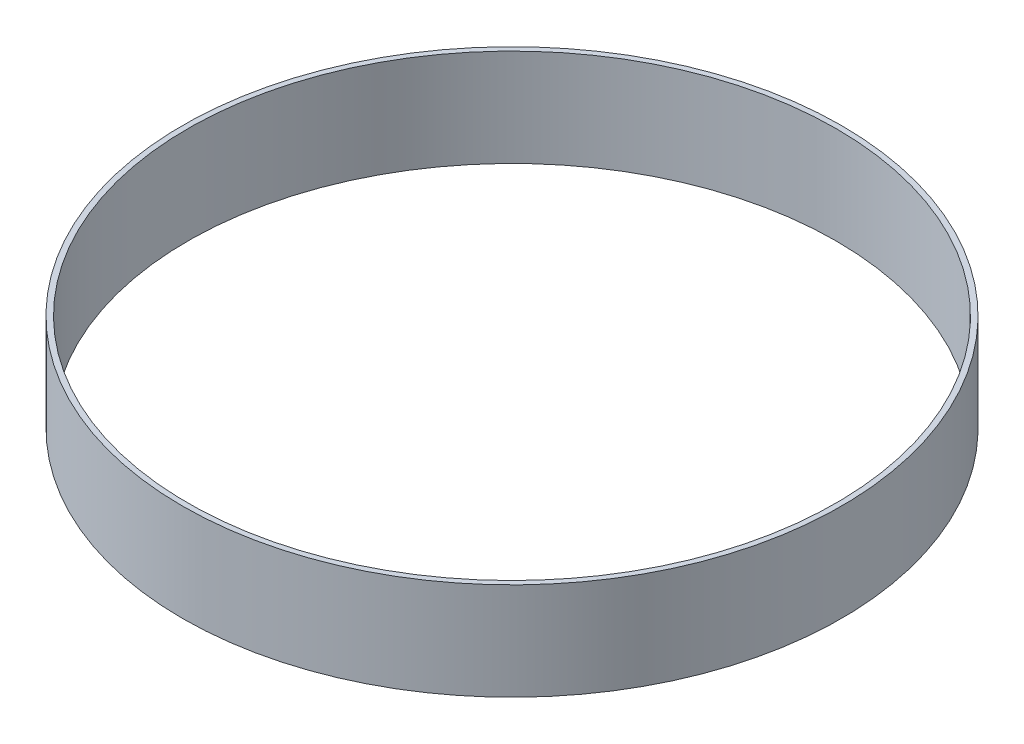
from build123d import *

# Parameters (mm, degrees)
SKETCH1_R      = 257.96875
SKETCH1_R_2    = 253.79299
EXTRUDE1_DEPTH = 76.2


with BuildPart() as part:
    # Sketch1 → Extrude1 (new body)
    with BuildSketch(Plane(origin=(0, 0, 0), x_dir=(1, 0, 0), z_dir=(0, 1, 0))):
        with Locations(Location((0, 0, 0), (0, 0, 90))):
            Circle(SKETCH1_R)
        with Locations(Location((0, 0, 0), (0, 0, 90))):
            Circle(SKETCH1_R_2, mode=Mode.SUBTRACT)
    extrude(amount=EXTRUDE1_DEPTH)


solid = part.part
